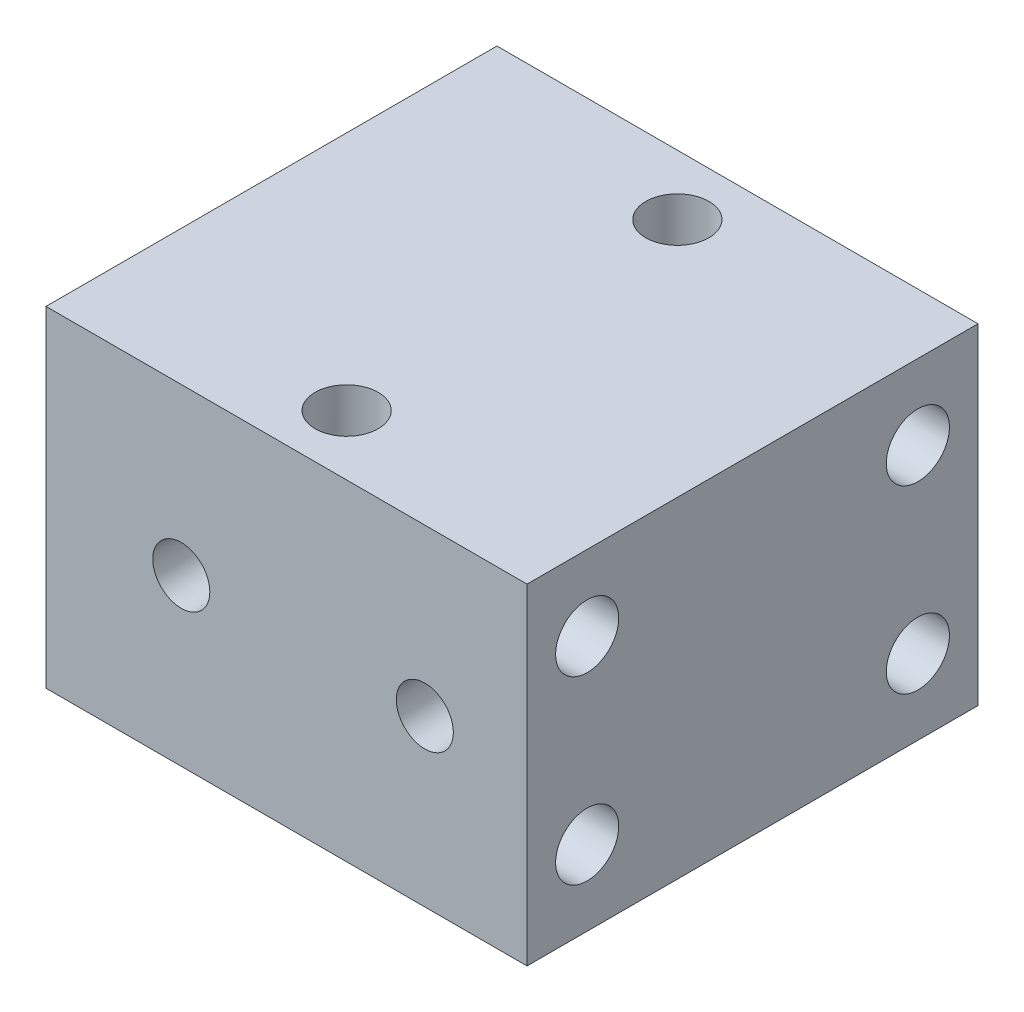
from build123d import *

# Parameters (mm, degrees)
SKETCH1_W                         = 80
SKETCH1_H                         = 75
SKETCH1_R                         = 5.25
EXTRUDE_H1_DEPTH                  = 55
SKETCH2_R                         = 0.5
CENTER_HOLE_DEPTH                 = 60
F_1_8_NPT_TAPPED_HOLE1_AT_2_COUNT = 2
F_1_8_NPT_TAPPED_HOLE1_AT_2_PITCH = 40.5
MTG_HOLE_REACH                    = 106.073
SKETCH6_R                         = 5.25
SKETCH5_R                         = 2
OIL_HOLE_DEPTH                    = 20


with BuildPart() as part:
    # Sketch1 → Extrude H1 (new body)
    with BuildSketch(Plane(origin=(0, 0, 0), x_dir=(1, 0, 0), z_dir=(0, 1, 0))):
        Rectangle(SKETCH1_W, SKETCH1_H)
        with Locations(Location((0, 27.5, 0), (0, 0, 270))):
            Circle(SKETCH1_R, mode=Mode.SUBTRACT)
        with Locations(Location((0, -27.5, 0), (0, 0, 270))):
            Circle(SKETCH1_R, mode=Mode.SUBTRACT)
    extrude(amount=EXTRUDE_H1_DEPTH)

    # Sketch2 → CENTER HOLE (cut)
    with BuildSketch(Plane.ZY.offset(40)):
        with Locations((0, 27.5)):
            Circle(SKETCH2_R)
    extrude(amount=-CENTER_HOLE_DEPTH, mode=Mode.SUBTRACT)

    # Sketch3 → 1_8 NPT Tapped Hole1 (revolve, cut)
    with BuildSketch(Plane(origin=(23, 27.5, 37.5), x_dir=(0, -1, 0), z_dir=(1, 0, 0))):
        Polygon((0, 0), (0, 14.153468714), (4.2164, 11.62), (4.2164, 6.92), (4.537398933, 6.92), (4.744593, 0), align=None)
    f_1_8_npt_tapped_hole1 = revolve(axis=Axis((23, 27.5, 43.85), (0, 0, -1)), mode=Mode.SUBTRACT)

    # 1_8 NPT Tapped Hole1 at 2: 1_8 NPT Tapped Hole1 ×2
    with Locations(*[(-i * F_1_8_NPT_TAPPED_HOLE1_AT_2_PITCH, 0, 0) for i in range(1, F_1_8_NPT_TAPPED_HOLE1_AT_2_COUNT)]):
        add(f_1_8_npt_tapped_hole1, mode=Mode.SUBTRACT)

    # MTG HOLE: up to this face of the body (flat: up to its plane)
    mtg_hole_end = Plane(part.part.faces().sort_by_distance((40, 27.5, 0))[0])
    # Sketch6 → MTG HOLE (cut, up to the picked face)
    with BuildSketch(Plane.ZY.offset(40), mode=Mode.PRIVATE) as mtg_hole_sk1:
        with Locations((-27.5, 42.5)):
            Circle(SKETCH6_R)
    mtg_hole_tool1 = split(extrude(mtg_hole_sk1.sketch, amount=-MTG_HOLE_REACH, mode=Mode.PRIVATE), bisect_by=mtg_hole_end, keep=Keep.BOTH, mode=Mode.PRIVATE)
    # Sketch6 → MTG HOLE (cut, up to the picked face)
    with BuildSketch(Plane.ZY.offset(40), mode=Mode.PRIVATE) as mtg_hole_sk2:
        with Locations((-27.5, 12.5)):
            Circle(SKETCH6_R)
    mtg_hole_tool2 = split(extrude(mtg_hole_sk2.sketch, amount=-MTG_HOLE_REACH, mode=Mode.PRIVATE), bisect_by=mtg_hole_end, keep=Keep.BOTH, mode=Mode.PRIVATE)
    # Sketch6 → MTG HOLE (cut, up to the picked face)
    with BuildSketch(Plane.ZY.offset(40), mode=Mode.PRIVATE) as mtg_hole_sk3:
        with Locations((27.5, 42.5)):
            Circle(SKETCH6_R)
    mtg_hole_tool3 = split(extrude(mtg_hole_sk3.sketch, amount=-MTG_HOLE_REACH, mode=Mode.PRIVATE), bisect_by=mtg_hole_end, keep=Keep.BOTH, mode=Mode.PRIVATE)
    # Sketch6 → MTG HOLE (cut, up to the picked face)
    with BuildSketch(Plane.ZY.offset(40), mode=Mode.PRIVATE) as mtg_hole_sk4:
        with Locations((27.5, 12.5)):
            Circle(SKETCH6_R)
    mtg_hole_tool4 = split(extrude(mtg_hole_sk4.sketch, amount=-MTG_HOLE_REACH, mode=Mode.PRIVATE), bisect_by=mtg_hole_end, keep=Keep.BOTH, mode=Mode.PRIVATE)
    add(mtg_hole_tool1.solids().sort_by(Axis((-40, 42.5, -27.5), (1, 0, 0)))[0], mode=Mode.SUBTRACT)
    add(mtg_hole_tool2.solids().sort_by(Axis((-40, 12.5, -27.5), (1, 0, 0)))[0], mode=Mode.SUBTRACT)
    add(mtg_hole_tool3.solids().sort_by(Axis((-40, 42.5, 27.5), (1, 0, 0)))[0], mode=Mode.SUBTRACT)
    add(mtg_hole_tool4.solids().sort_by(Axis((-40, 12.5, 27.5), (1, 0, 0)))[0], mode=Mode.SUBTRACT)

    # Sketch5 → OIL HOLE (cut)
    with BuildSketch(Plane.XY.offset(37.5)):
        with Locations((-17.5, 27.5)):
            Circle(SKETCH5_R)
        with Locations((23, 27.5)):
            Circle(SKETCH5_R)
    extrude(amount=-OIL_HOLE_DEPTH, mode=Mode.SUBTRACT)


solid = part.part
